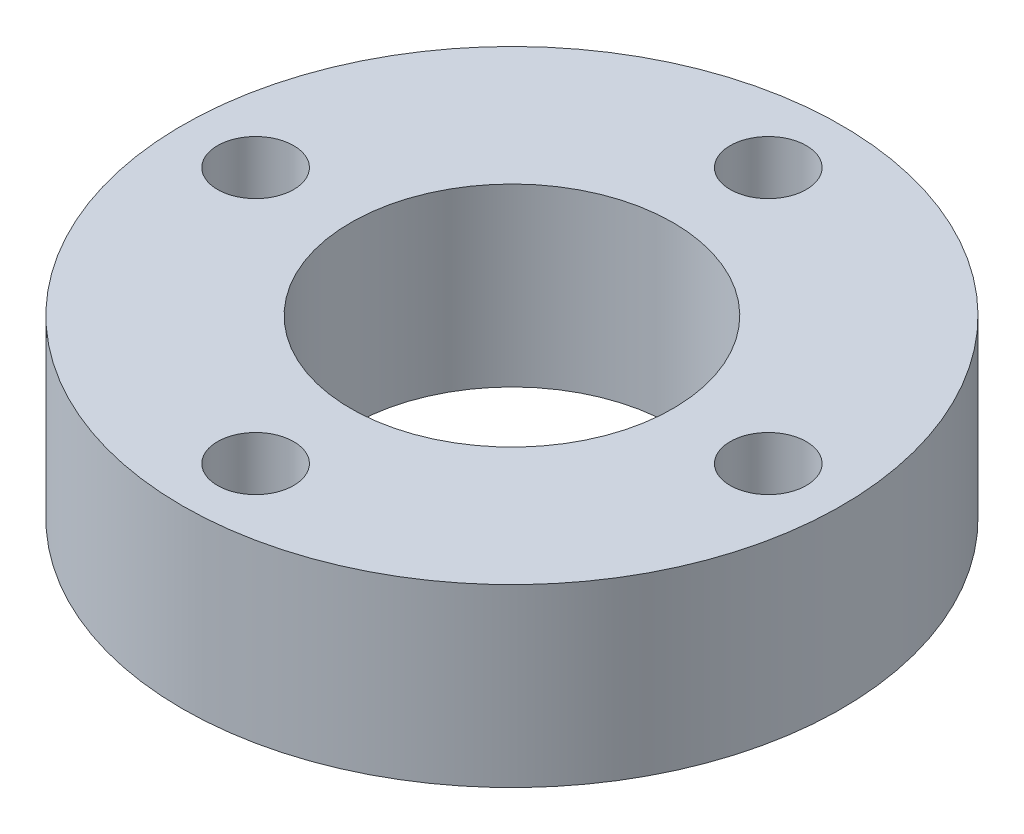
ISO-10303-21;
HEADER;
FILE_DESCRIPTION(('STEP AP214'),'2;1');
FILE_NAME('part.step','',(''),(''),'','','');
FILE_SCHEMA(('AUTOMOTIVE_DESIGN { 1 0 10303 214 1 1 1 1 }'));
ENDSEC;
DATA;
#1=APPLICATION_CONTEXT('core data for automotive mechanical design processes');
#2=APPLICATION_PROTOCOL_DEFINITION('international standard','automotive_design',2000,#1);
#3=PRODUCT_CONTEXT('',#1,'mechanical');
#4=PRODUCT('Part','Part','',(#3));
#5=PRODUCT_RELATED_PRODUCT_CATEGORY('part','',(#4));
#6=PRODUCT_DEFINITION_FORMATION('','',#4);
#7=PRODUCT_DEFINITION_CONTEXT('part definition',#1,'design');
#8=PRODUCT_DEFINITION('design','',#6,#7);
#9=PRODUCT_DEFINITION_SHAPE('','',#8);
#10=(LENGTH_UNIT() NAMED_UNIT(*) SI_UNIT(.MILLI.,.METRE.));
#11=(NAMED_UNIT(*) PLANE_ANGLE_UNIT() SI_UNIT($,.RADIAN.));
#12=(NAMED_UNIT(*) SI_UNIT($,.STERADIAN.) SOLID_ANGLE_UNIT());
#13=UNCERTAINTY_MEASURE_WITH_UNIT(LENGTH_MEASURE(1.E-05),#10,'distance_accuracy_value','');
#14=(GEOMETRIC_REPRESENTATION_CONTEXT(3) GLOBAL_UNCERTAINTY_ASSIGNED_CONTEXT((#13)) GLOBAL_UNIT_ASSIGNED_CONTEXT((#10,
#11,#12)) REPRESENTATION_CONTEXT('',''));
#15=CARTESIAN_POINT('',(0.,0.,0.));
#16=DIRECTION('',(0.,0.,1.));
#17=DIRECTION('',(1.,0.,0.));
#18=AXIS2_PLACEMENT_3D('',#15,#16,#17);
#19=CARTESIAN_POINT('',(0.,12.,0.));
#20=DIRECTION('',(0.,-1.,0.));
#21=DIRECTION('',(0.,0.,-1.));
#22=AXIS2_PLACEMENT_3D('',#19,#20,#21);
#23=CYLINDRICAL_SURFACE('',#22,22.5);
#24=CARTESIAN_POINT('',(0.,12.,0.));
#25=DIRECTION('',(0.,1.,0.));
#26=DIRECTION('',(0.,0.,1.));
#27=AXIS2_PLACEMENT_3D('',#24,#25,#26);
#28=CIRCLE('',#27,22.5);
#29=CARTESIAN_POINT('',(0.,12.,22.5));
#30=VERTEX_POINT('',#29);
#31=EDGE_CURVE('E11',#30,#30,#28,.T.);
#32=ORIENTED_EDGE('',*,*,#31,.F.);
#33=EDGE_LOOP('',(#32));
#34=FACE_BOUND('',#33,.T.);
#35=CARTESIAN_POINT('',(0.,0.,0.));
#36=DIRECTION('',(0.,1.,0.));
#37=DIRECTION('',(0.,0.,1.));
#38=AXIS2_PLACEMENT_3D('',#35,#36,#37);
#39=CIRCLE('',#38,22.5);
#40=CARTESIAN_POINT('',(0.,0.,22.5));
#41=VERTEX_POINT('',#40);
#42=EDGE_CURVE('E54',#41,#41,#39,.T.);
#43=ORIENTED_EDGE('',*,*,#42,.T.);
#44=EDGE_LOOP('',(#43));
#45=FACE_BOUND('',#44,.T.);
#46=ADVANCED_FACE('F48',(#34,#45),#23,.T.);
#47=CARTESIAN_POINT('',(0.,12.,0.));
#48=DIRECTION('',(0.,1.,0.));
#49=DIRECTION('',(0.,0.,1.));
#50=AXIS2_PLACEMENT_3D('',#47,#48,#49);
#51=PLANE('',#50);
#52=CARTESIAN_POINT('',(0.,12.,0.));
#53=DIRECTION('',(0.,-1.,0.));
#54=DIRECTION('',(0.,0.,-1.));
#55=AXIS2_PLACEMENT_3D('',#52,#53,#54);
#56=CIRCLE('',#55,11.);
#57=CARTESIAN_POINT('',(0.,12.,-11.));
#58=VERTEX_POINT('',#57);
#59=EDGE_CURVE('E108',#58,#58,#56,.T.);
#60=ORIENTED_EDGE('',*,*,#59,.T.);
#61=EDGE_LOOP('',(#60));
#62=FACE_BOUND('',#61,.T.);
#63=CARTESIAN_POINT('',(0.,12.,17.5));
#64=DIRECTION('',(0.,-1.,0.));
#65=DIRECTION('',(0.,0.,-1.));
#66=AXIS2_PLACEMENT_3D('',#63,#64,#65);
#67=CIRCLE('',#66,2.6);
#68=CARTESIAN_POINT('',(0.,12.,14.9));
#69=VERTEX_POINT('',#68);
#70=EDGE_CURVE('E66',#69,#69,#67,.T.);
#71=ORIENTED_EDGE('',*,*,#70,.T.);
#72=EDGE_LOOP('',(#71));
#73=FACE_BOUND('',#72,.T.);
#74=CARTESIAN_POINT('',(17.5,12.,0.));
#75=DIRECTION('',(0.,-1.,0.));
#76=DIRECTION('',(0.,0.,-1.));
#77=AXIS2_PLACEMENT_3D('',#74,#75,#76);
#78=CIRCLE('',#77,2.6);
#79=CARTESIAN_POINT('',(17.5,12.,-2.6));
#80=VERTEX_POINT('',#79);
#81=EDGE_CURVE('E111',#80,#80,#78,.T.);
#82=ORIENTED_EDGE('',*,*,#81,.T.);
#83=EDGE_LOOP('',(#82));
#84=FACE_BOUND('',#83,.T.);
#85=CARTESIAN_POINT('',(0.,12.,-17.5));
#86=DIRECTION('',(0.,-1.,0.));
#87=DIRECTION('',(0.,0.,-1.));
#88=AXIS2_PLACEMENT_3D('',#85,#86,#87);
#89=CIRCLE('',#88,2.6);
#90=CARTESIAN_POINT('',(0.,12.,-20.1));
#91=VERTEX_POINT('',#90);
#92=EDGE_CURVE('E110',#91,#91,#89,.T.);
#93=ORIENTED_EDGE('',*,*,#92,.T.);
#94=EDGE_LOOP('',(#93));
#95=FACE_BOUND('',#94,.T.);
#96=CARTESIAN_POINT('',(-17.5,12.,0.));
#97=DIRECTION('',(0.,-1.,0.));
#98=DIRECTION('',(0.,0.,-1.));
#99=AXIS2_PLACEMENT_3D('',#96,#97,#98);
#100=CIRCLE('',#99,2.6);
#101=CARTESIAN_POINT('',(-17.5,12.,-2.6));
#102=VERTEX_POINT('',#101);
#103=EDGE_CURVE('E104',#102,#102,#100,.T.);
#104=ORIENTED_EDGE('',*,*,#103,.T.);
#105=EDGE_LOOP('',(#104));
#106=FACE_BOUND('',#105,.T.);
#107=ORIENTED_EDGE('',*,*,#31,.T.);
#108=EDGE_LOOP('',(#107));
#109=FACE_BOUND('',#108,.T.);
#110=ADVANCED_FACE('F125',(#62,#73,#84,#95,#106,#109),#51,.T.);
#111=CARTESIAN_POINT('',(0.,0.,0.));
#112=DIRECTION('',(0.,1.,0.));
#113=DIRECTION('',(0.,0.,1.));
#114=AXIS2_PLACEMENT_3D('',#111,#112,#113);
#115=PLANE('',#114);
#116=CARTESIAN_POINT('',(0.,0.,0.));
#117=DIRECTION('',(0.,-1.,0.));
#118=DIRECTION('',(0.,0.,-1.));
#119=AXIS2_PLACEMENT_3D('',#116,#117,#118);
#120=CIRCLE('',#119,11.);
#121=CARTESIAN_POINT('',(0.,0.,-11.));
#122=VERTEX_POINT('',#121);
#123=EDGE_CURVE('E116',#122,#122,#120,.T.);
#124=ORIENTED_EDGE('',*,*,#123,.F.);
#125=EDGE_LOOP('',(#124));
#126=FACE_BOUND('',#125,.T.);
#127=CARTESIAN_POINT('',(17.5,0.,0.));
#128=DIRECTION('',(0.,-1.,0.));
#129=DIRECTION('',(0.,0.,-1.));
#130=AXIS2_PLACEMENT_3D('',#127,#128,#129);
#131=CIRCLE('',#130,4.2);
#132=CARTESIAN_POINT('',(17.5,0.,-4.2));
#133=VERTEX_POINT('',#132);
#134=EDGE_CURVE('E100',#133,#133,#131,.T.);
#135=ORIENTED_EDGE('',*,*,#134,.F.);
#136=EDGE_LOOP('',(#135));
#137=FACE_BOUND('',#136,.T.);
#138=CARTESIAN_POINT('',(0.,0.,-17.5));
#139=DIRECTION('',(0.,-1.,0.));
#140=DIRECTION('',(0.,0.,-1.));
#141=AXIS2_PLACEMENT_3D('',#138,#139,#140);
#142=CIRCLE('',#141,4.2);
#143=CARTESIAN_POINT('',(0.,0.,-21.7));
#144=VERTEX_POINT('',#143);
#145=EDGE_CURVE('E98',#144,#144,#142,.T.);
#146=ORIENTED_EDGE('',*,*,#145,.F.);
#147=EDGE_LOOP('',(#146));
#148=FACE_BOUND('',#147,.T.);
#149=CARTESIAN_POINT('',(0.,0.,17.5));
#150=DIRECTION('',(0.,-1.,0.));
#151=DIRECTION('',(0.,0.,-1.));
#152=AXIS2_PLACEMENT_3D('',#149,#150,#151);
#153=CIRCLE('',#152,4.2);
#154=CARTESIAN_POINT('',(0.,0.,13.3));
#155=VERTEX_POINT('',#154);
#156=EDGE_CURVE('E88',#155,#155,#153,.T.);
#157=ORIENTED_EDGE('',*,*,#156,.F.);
#158=EDGE_LOOP('',(#157));
#159=FACE_BOUND('',#158,.T.);
#160=CARTESIAN_POINT('',(-17.5,0.,0.));
#161=DIRECTION('',(0.,-1.,0.));
#162=DIRECTION('',(0.,0.,-1.));
#163=AXIS2_PLACEMENT_3D('',#160,#161,#162);
#164=CIRCLE('',#163,4.2);
#165=CARTESIAN_POINT('',(-17.5,0.,-4.2));
#166=VERTEX_POINT('',#165);
#167=EDGE_CURVE('E78',#166,#166,#164,.T.);
#168=ORIENTED_EDGE('',*,*,#167,.F.);
#169=EDGE_LOOP('',(#168));
#170=FACE_BOUND('',#169,.T.);
#171=ORIENTED_EDGE('',*,*,#42,.F.);
#172=EDGE_LOOP('',(#171));
#173=FACE_BOUND('',#172,.T.);
#174=ADVANCED_FACE('F135',(#126,#137,#148,#159,#170,#173),#115,.F.);
#175=CARTESIAN_POINT('',(-17.5,4.4,0.));
#176=DIRECTION('',(0.,-1.,0.));
#177=DIRECTION('',(0.,0.,-1.));
#178=AXIS2_PLACEMENT_3D('',#175,#176,#177);
#179=CYLINDRICAL_SURFACE('',#178,4.2);
#180=ORIENTED_EDGE('',*,*,#167,.T.);
#181=EDGE_LOOP('',(#180));
#182=FACE_BOUND('',#181,.T.);
#183=CARTESIAN_POINT('',(-17.5,4.4,0.));
#184=DIRECTION('',(0.,-1.,0.));
#185=DIRECTION('',(0.,0.,-1.));
#186=AXIS2_PLACEMENT_3D('',#183,#184,#185);
#187=CIRCLE('',#186,4.2);
#188=CARTESIAN_POINT('',(-17.5,4.4,-4.2));
#189=VERTEX_POINT('',#188);
#190=EDGE_CURVE('E64',#189,#189,#187,.T.);
#191=ORIENTED_EDGE('',*,*,#190,.F.);
#192=EDGE_LOOP('',(#191));
#193=FACE_BOUND('',#192,.T.);
#194=ADVANCED_FACE('F131',(#182,#193),#179,.F.);
#195=CARTESIAN_POINT('',(0.,4.4,0.));
#196=DIRECTION('',(0.,-1.,0.));
#197=DIRECTION('',(0.,0.,-1.));
#198=AXIS2_PLACEMENT_3D('',#195,#196,#197);
#199=PLANE('',#198);
#200=CARTESIAN_POINT('',(-17.5,4.4,0.));
#201=DIRECTION('',(0.,-1.,0.));
#202=DIRECTION('',(0.,0.,-1.));
#203=AXIS2_PLACEMENT_3D('',#200,#201,#202);
#204=CIRCLE('',#203,2.6);
#205=CARTESIAN_POINT('',(-17.5,4.4,-2.6));
#206=VERTEX_POINT('',#205);
#207=EDGE_CURVE('E51',#206,#206,#204,.T.);
#208=ORIENTED_EDGE('',*,*,#207,.F.);
#209=EDGE_LOOP('',(#208));
#210=FACE_BOUND('',#209,.T.);
#211=ORIENTED_EDGE('',*,*,#190,.T.);
#212=EDGE_LOOP('',(#211));
#213=FACE_BOUND('',#212,.T.);
#214=ADVANCED_FACE('F158',(#210,#213),#199,.T.);
#215=CARTESIAN_POINT('',(0.,4.4,17.5));
#216=DIRECTION('',(0.,-1.,0.));
#217=DIRECTION('',(0.,0.,-1.));
#218=AXIS2_PLACEMENT_3D('',#215,#216,#217);
#219=CYLINDRICAL_SURFACE('',#218,4.2);
#220=CARTESIAN_POINT('',(0.,4.4,17.5));
#221=DIRECTION('',(0.,-1.,0.));
#222=DIRECTION('',(0.,0.,-1.));
#223=AXIS2_PLACEMENT_3D('',#220,#221,#222);
#224=CIRCLE('',#223,4.2);
#225=CARTESIAN_POINT('',(0.,4.4,13.3));
#226=VERTEX_POINT('',#225);
#227=EDGE_CURVE('E81',#226,#226,#224,.T.);
#228=ORIENTED_EDGE('',*,*,#227,.F.);
#229=EDGE_LOOP('',(#228));
#230=FACE_BOUND('',#229,.T.);
#231=ORIENTED_EDGE('',*,*,#156,.T.);
#232=EDGE_LOOP('',(#231));
#233=FACE_BOUND('',#232,.T.);
#234=ADVANCED_FACE('F157',(#230,#233),#219,.F.);
#235=CARTESIAN_POINT('',(0.,4.4,0.));
#236=DIRECTION('',(0.,-1.,0.));
#237=DIRECTION('',(0.,0.,-1.));
#238=AXIS2_PLACEMENT_3D('',#235,#236,#237);
#239=PLANE('',#238);
#240=CARTESIAN_POINT('',(0.,4.4,17.5));
#241=DIRECTION('',(0.,-1.,0.));
#242=DIRECTION('',(0.,0.,-1.));
#243=AXIS2_PLACEMENT_3D('',#240,#241,#242);
#244=CIRCLE('',#243,2.6);
#245=CARTESIAN_POINT('',(0.,4.4,14.9));
#246=VERTEX_POINT('',#245);
#247=EDGE_CURVE('E75',#246,#246,#244,.T.);
#248=ORIENTED_EDGE('',*,*,#247,.F.);
#249=EDGE_LOOP('',(#248));
#250=FACE_BOUND('',#249,.T.);
#251=ORIENTED_EDGE('',*,*,#227,.T.);
#252=EDGE_LOOP('',(#251));
#253=FACE_BOUND('',#252,.T.);
#254=ADVANCED_FACE('F162',(#250,#253),#239,.T.);
#255=CARTESIAN_POINT('',(0.,4.4,-17.5));
#256=DIRECTION('',(0.,-1.,0.));
#257=DIRECTION('',(0.,0.,-1.));
#258=AXIS2_PLACEMENT_3D('',#255,#256,#257);
#259=CYLINDRICAL_SURFACE('',#258,4.2);
#260=CARTESIAN_POINT('',(0.,4.4,-17.5));
#261=DIRECTION('',(0.,-1.,0.));
#262=DIRECTION('',(0.,0.,-1.));
#263=AXIS2_PLACEMENT_3D('',#260,#261,#262);
#264=CIRCLE('',#263,4.2);
#265=CARTESIAN_POINT('',(0.,4.4,-21.7));
#266=VERTEX_POINT('',#265);
#267=EDGE_CURVE('E91',#266,#266,#264,.T.);
#268=ORIENTED_EDGE('',*,*,#267,.F.);
#269=EDGE_LOOP('',(#268));
#270=FACE_BOUND('',#269,.T.);
#271=ORIENTED_EDGE('',*,*,#145,.T.);
#272=EDGE_LOOP('',(#271));
#273=FACE_BOUND('',#272,.T.);
#274=ADVANCED_FACE('F164',(#270,#273),#259,.F.);
#275=CARTESIAN_POINT('',(0.,4.4,0.));
#276=DIRECTION('',(0.,-1.,0.));
#277=DIRECTION('',(0.,0.,-1.));
#278=AXIS2_PLACEMENT_3D('',#275,#276,#277);
#279=PLANE('',#278);
#280=CARTESIAN_POINT('',(0.,4.4,-17.5));
#281=DIRECTION('',(0.,-1.,0.));
#282=DIRECTION('',(0.,0.,-1.));
#283=AXIS2_PLACEMENT_3D('',#280,#281,#282);
#284=CIRCLE('',#283,2.6);
#285=CARTESIAN_POINT('',(0.,4.4,-20.1));
#286=VERTEX_POINT('',#285);
#287=EDGE_CURVE('E69',#286,#286,#284,.T.);
#288=ORIENTED_EDGE('',*,*,#287,.F.);
#289=EDGE_LOOP('',(#288));
#290=FACE_BOUND('',#289,.T.);
#291=ORIENTED_EDGE('',*,*,#267,.T.);
#292=EDGE_LOOP('',(#291));
#293=FACE_BOUND('',#292,.T.);
#294=ADVANCED_FACE('F167',(#290,#293),#279,.T.);
#295=CARTESIAN_POINT('',(17.5,4.4,0.));
#296=DIRECTION('',(0.,-1.,0.));
#297=DIRECTION('',(0.,0.,-1.));
#298=AXIS2_PLACEMENT_3D('',#295,#296,#297);
#299=CYLINDRICAL_SURFACE('',#298,4.2);
#300=CARTESIAN_POINT('',(17.5,4.4,0.));
#301=DIRECTION('',(0.,-1.,0.));
#302=DIRECTION('',(0.,0.,-1.));
#303=AXIS2_PLACEMENT_3D('',#300,#301,#302);
#304=CIRCLE('',#303,4.2);
#305=CARTESIAN_POINT('',(17.5,4.4,-4.2));
#306=VERTEX_POINT('',#305);
#307=EDGE_CURVE('E58',#306,#306,#304,.T.);
#308=ORIENTED_EDGE('',*,*,#307,.F.);
#309=EDGE_LOOP('',(#308));
#310=FACE_BOUND('',#309,.T.);
#311=ORIENTED_EDGE('',*,*,#134,.T.);
#312=EDGE_LOOP('',(#311));
#313=FACE_BOUND('',#312,.T.);
#314=ADVANCED_FACE('F173',(#310,#313),#299,.F.);
#315=CARTESIAN_POINT('',(0.,4.4,0.));
#316=DIRECTION('',(0.,-1.,0.));
#317=DIRECTION('',(0.,0.,-1.));
#318=AXIS2_PLACEMENT_3D('',#315,#316,#317);
#319=PLANE('',#318);
#320=CARTESIAN_POINT('',(17.5,4.4,0.));
#321=DIRECTION('',(0.,-1.,0.));
#322=DIRECTION('',(0.,0.,-1.));
#323=AXIS2_PLACEMENT_3D('',#320,#321,#322);
#324=CIRCLE('',#323,2.6);
#325=CARTESIAN_POINT('',(17.5,4.4,-2.6));
#326=VERTEX_POINT('',#325);
#327=EDGE_CURVE('E67',#326,#326,#324,.T.);
#328=ORIENTED_EDGE('',*,*,#327,.F.);
#329=EDGE_LOOP('',(#328));
#330=FACE_BOUND('',#329,.T.);
#331=ORIENTED_EDGE('',*,*,#307,.T.);
#332=EDGE_LOOP('',(#331));
#333=FACE_BOUND('',#332,.T.);
#334=ADVANCED_FACE('F179',(#330,#333),#319,.T.);
#335=CARTESIAN_POINT('',(17.5,12.,0.));
#336=DIRECTION('',(0.,-1.,0.));
#337=DIRECTION('',(0.,0.,-1.));
#338=AXIS2_PLACEMENT_3D('',#335,#336,#337);
#339=CYLINDRICAL_SURFACE('',#338,2.6);
#340=ORIENTED_EDGE('',*,*,#327,.T.);
#341=EDGE_LOOP('',(#340));
#342=FACE_BOUND('',#341,.T.);
#343=ORIENTED_EDGE('',*,*,#81,.F.);
#344=EDGE_LOOP('',(#343));
#345=FACE_BOUND('',#344,.T.);
#346=ADVANCED_FACE('F183',(#342,#345),#339,.F.);
#347=CARTESIAN_POINT('',(0.,12.,-17.5));
#348=DIRECTION('',(0.,-1.,0.));
#349=DIRECTION('',(0.,0.,-1.));
#350=AXIS2_PLACEMENT_3D('',#347,#348,#349);
#351=CYLINDRICAL_SURFACE('',#350,2.6);
#352=ORIENTED_EDGE('',*,*,#287,.T.);
#353=EDGE_LOOP('',(#352));
#354=FACE_BOUND('',#353,.T.);
#355=ORIENTED_EDGE('',*,*,#92,.F.);
#356=EDGE_LOOP('',(#355));
#357=FACE_BOUND('',#356,.T.);
#358=ADVANCED_FACE('F189',(#354,#357),#351,.F.);
#359=CARTESIAN_POINT('',(0.,12.,17.5));
#360=DIRECTION('',(0.,-1.,0.));
#361=DIRECTION('',(0.,0.,-1.));
#362=AXIS2_PLACEMENT_3D('',#359,#360,#361);
#363=CYLINDRICAL_SURFACE('',#362,2.6);
#364=ORIENTED_EDGE('',*,*,#247,.T.);
#365=EDGE_LOOP('',(#364));
#366=FACE_BOUND('',#365,.T.);
#367=ORIENTED_EDGE('',*,*,#70,.F.);
#368=EDGE_LOOP('',(#367));
#369=FACE_BOUND('',#368,.T.);
#370=ADVANCED_FACE('F190',(#366,#369),#363,.F.);
#371=CARTESIAN_POINT('',(-17.5,12.,0.));
#372=DIRECTION('',(0.,-1.,0.));
#373=DIRECTION('',(0.,0.,-1.));
#374=AXIS2_PLACEMENT_3D('',#371,#372,#373);
#375=CYLINDRICAL_SURFACE('',#374,2.6);
#376=ORIENTED_EDGE('',*,*,#207,.T.);
#377=EDGE_LOOP('',(#376));
#378=FACE_BOUND('',#377,.T.);
#379=ORIENTED_EDGE('',*,*,#103,.F.);
#380=EDGE_LOOP('',(#379));
#381=FACE_BOUND('',#380,.T.);
#382=ADVANCED_FACE('F129',(#378,#381),#375,.F.);
#383=CARTESIAN_POINT('',(0.,12.,0.));
#384=DIRECTION('',(0.,-1.,0.));
#385=DIRECTION('',(0.,0.,-1.));
#386=AXIS2_PLACEMENT_3D('',#383,#384,#385);
#387=CYLINDRICAL_SURFACE('',#386,11.);
#388=ORIENTED_EDGE('',*,*,#59,.F.);
#389=EDGE_LOOP('',(#388));
#390=FACE_BOUND('',#389,.T.);
#391=ORIENTED_EDGE('',*,*,#123,.T.);
#392=EDGE_LOOP('',(#391));
#393=FACE_BOUND('',#392,.T.);
#394=ADVANCED_FACE('F123',(#390,#393),#387,.F.);
#395=CLOSED_SHELL('',(#46,#110,#174,#194,#214,#234,#254,#274,#294,#314,#334,#346,#358,#370,#382,#394));
#396=MANIFOLD_SOLID_BREP('B2',#395);
#397=ADVANCED_BREP_SHAPE_REPRESENTATION('',(#18,#396),#14);
#398=SHAPE_DEFINITION_REPRESENTATION(#9,#397);
ENDSEC;
END-ISO-10303-21;
